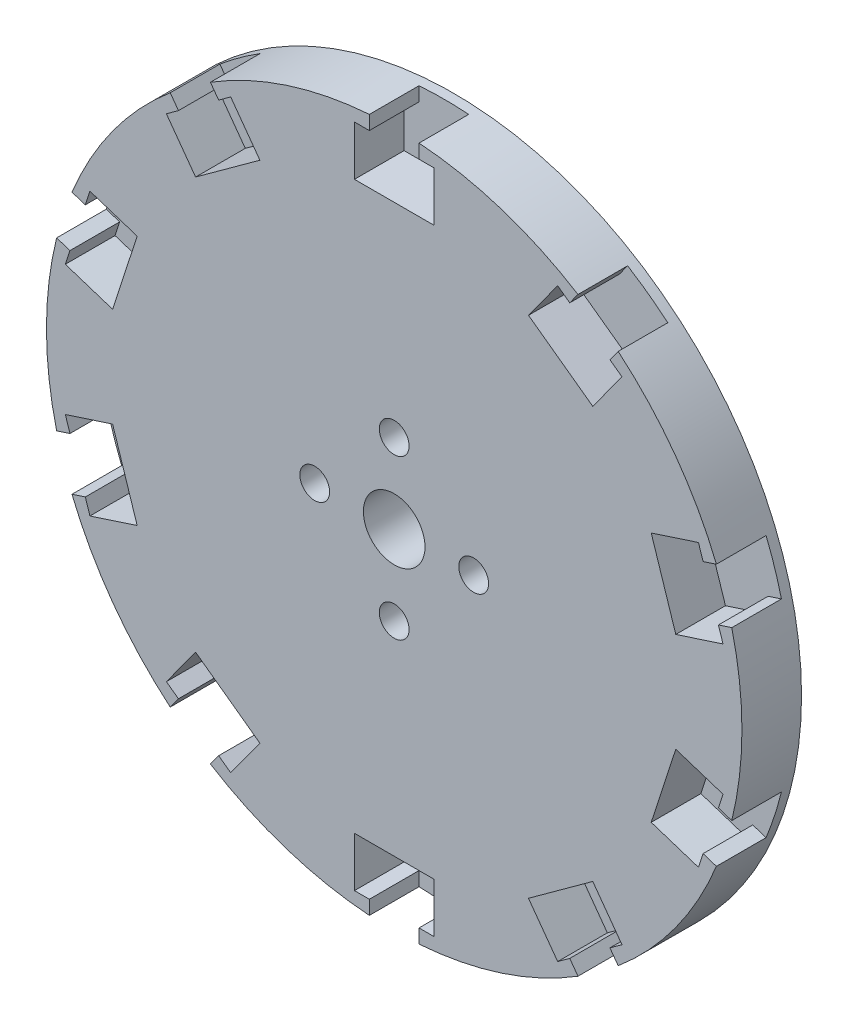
from build123d import *

# Parameters (mm, degrees)
ESQUISSE1_R                  = 35
ESQUISSE1_R_2                = 3.1
ESQUISSE1_R_3                = 1.5
EXTRUSION1_DEPTH             = 6
ENL_V_MAT_EXTRU_1_DEPTH      = 5
R_P_TITION_CIRCULAIRE1_COUNT = 10


with BuildPart() as part:
    # Esquisse1 → Extrusion1 (new body)
    with BuildSketch(Plane.XY):
        Circle(ESQUISSE1_R)
        Circle(ESQUISSE1_R_2, mode=Mode.SUBTRACT)
        with Locations((0, 8)):
            Circle(ESQUISSE1_R_3, mode=Mode.SUBTRACT)
        with Locations((-8, 0)):
            Circle(ESQUISSE1_R_3, mode=Mode.SUBTRACT)
        with Locations((0, -8)):
            Circle(ESQUISSE1_R_3, mode=Mode.SUBTRACT)
        with Locations((8, 0)):
            Circle(ESQUISSE1_R_3, mode=Mode.SUBTRACT)
    extrude(amount=EXTRUSION1_DEPTH)

    # Esquisse2 → Enl_v. mat.-Extru.1 (cut)
    with BuildSketch(Plane.XY.offset(6)):
        Polygon((2.5, 33.5), (4, 33.5), (4, 28.5), (-4, 28.5), (-4, 33.5), (-2.5, 33.5), (-2.5, 40.396091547), (2.5, 40.396091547), align=None)
    enl_v_mat_extru_1 = extrude(amount=-ENL_V_MAT_EXTRU_1_DEPTH, mode=Mode.SUBTRACT)

    # R_p_tition circulaire1: Enl_v. mat.-Extru.1 ×10 about axis
    r_p_tition_circulaire1_axis = Axis((0, 0, 0), (0, 0, 1))
    for i in range(1, R_P_TITION_CIRCULAIRE1_COUNT):
        add(enl_v_mat_extru_1.rotate(r_p_tition_circulaire1_axis, i * 360 / R_P_TITION_CIRCULAIRE1_COUNT), mode=Mode.SUBTRACT)


solid = part.part
